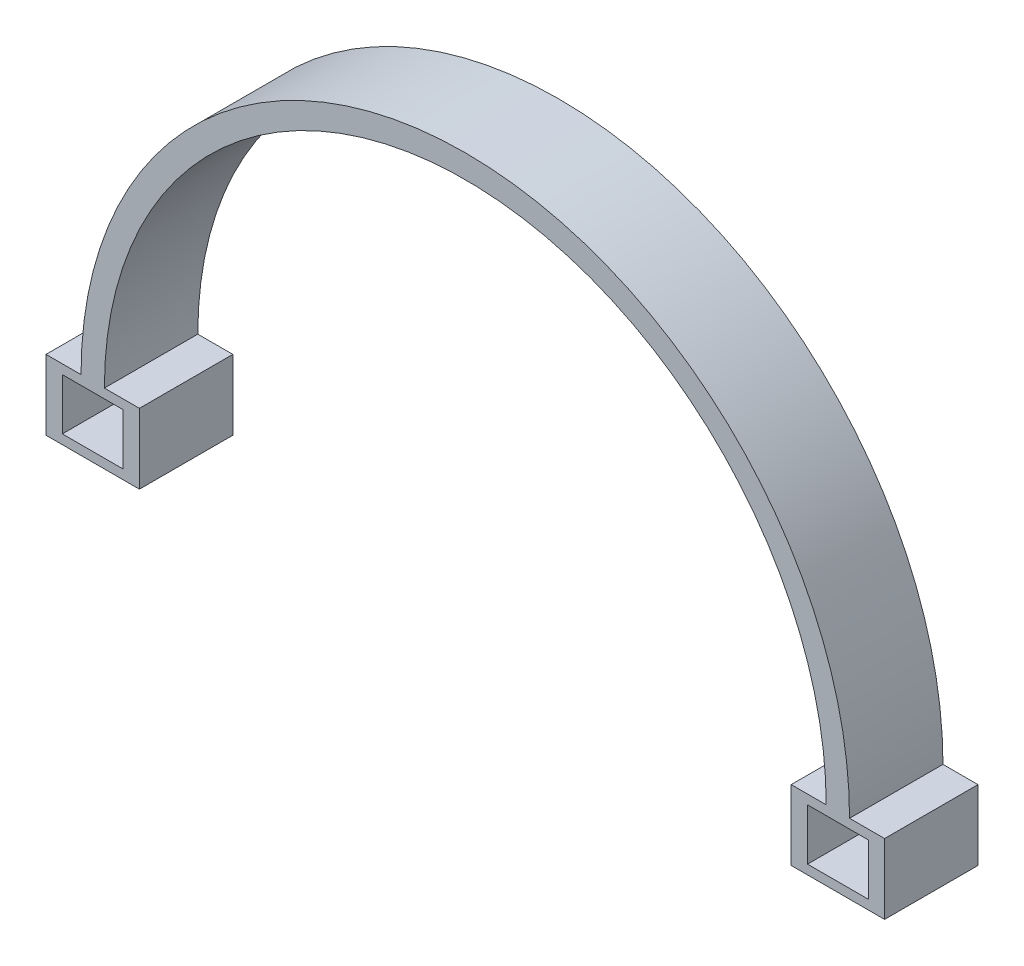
from build123d import *

# Parameters (mm, degrees)
BOSS_EXTRUDE1_DEPTH = 20
SKETCH2_W           = 20
SKETCH2_H           = 15
SKETCH2_W_2         = 13.004307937
SKETCH2_H_2         = 11
BOSS_EXTRUDE2_DEPTH = 20


with BuildPart() as part:
    # Sketch1 → Boss-Extrude1 (new body)
    with BuildSketch(Plane.XY):
        with BuildLine():
            Line((77.272727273, 0), (82.272727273, 0))
            ThreePointArc((82.272727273, 0), (0, 82.272727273), (-82.272727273, 0))
            Line((-82.272727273, 0), (-77.272727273, 0))
            ThreePointArc((-77.272727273, 0), (0, 77.272727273), (77.272727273, 0))
        make_face()
    extrude(amount=BOSS_EXTRUDE1_DEPTH)

    # Sketch2 → Boss-Extrude2 (add)
    with BuildSketch(Plane.XY.offset(20)):
        with Locations((-79.772727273, -7.5)):
            Rectangle(SKETCH2_W, SKETCH2_H)
        with Locations((-79.774881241, -7.5)):
            Rectangle(SKETCH2_W_2, SKETCH2_H_2, mode=Mode.SUBTRACT)
    boss_extrude2 = extrude(amount=-BOSS_EXTRUDE2_DEPTH)

    # Mirror9: Boss-Extrude2 across plane
    add(boss_extrude2.mirror(Plane(origin=(0, 0, 0), x_dir=(0, 0, 1), z_dir=(1, 0, 0))))


solid = part.part
